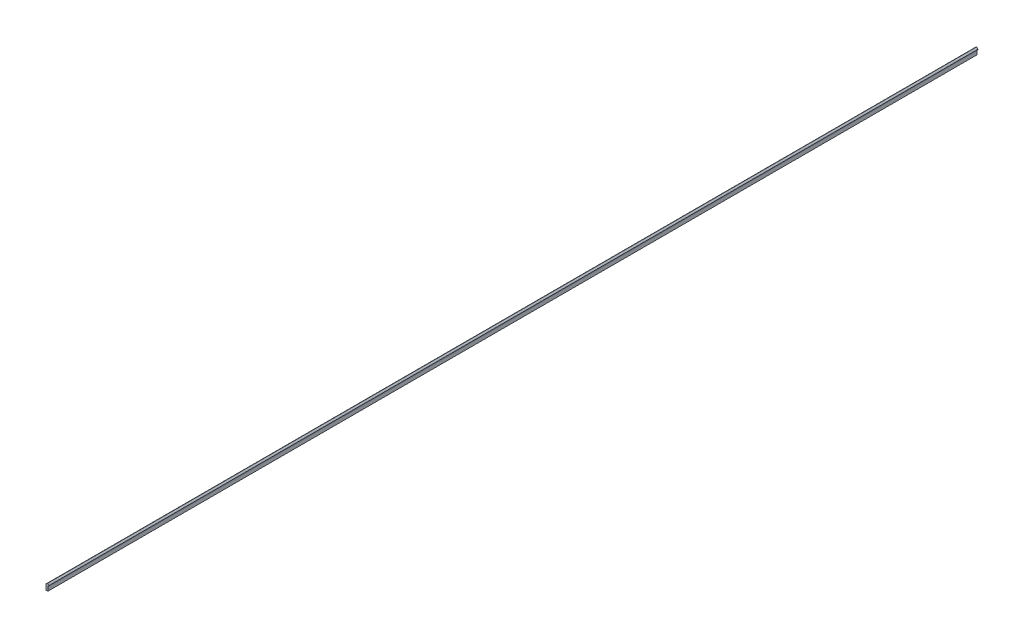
from build123d import *

# Parameters (mm, degrees)
BOSS_EXTRU_1_DEPTH = 2000
CONG_1_R           = 0.5


with BuildPart() as part:
    # Esquisse1 → Boss.-Extru.1 (new body)
    with BuildSketch(Plane.XY):
        Polygon((0, 11.825), (3.175, 15), (6.35, 11.825), (6.35, 10.399836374), (3.99, 10.399836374), (3.99, 0), (0, 0), align=None)
    extrude(amount=BOSS_EXTRU_1_DEPTH)

    # Cong_1
    cong_1_edges = [part.edges().sort_by_distance(p)[0] for p in [
        (3.175, 15, 1000),
    ]]
    fillet(cong_1_edges, radius=CONG_1_R)


solid = part.part
